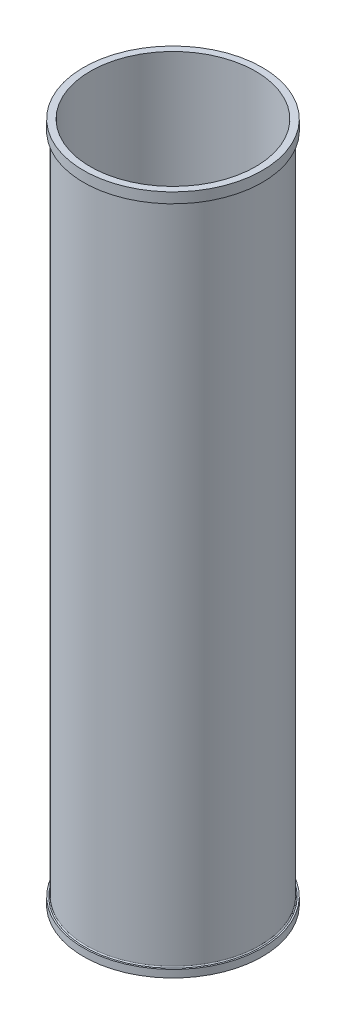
ISO-10303-21;
HEADER;
FILE_DESCRIPTION(('STEP AP214'),'2;1');
FILE_NAME('part.step','',(''),(''),'','','');
FILE_SCHEMA(('AUTOMOTIVE_DESIGN { 1 0 10303 214 1 1 1 1 }'));
ENDSEC;
DATA;
#1=APPLICATION_CONTEXT('core data for automotive mechanical design processes');
#2=APPLICATION_PROTOCOL_DEFINITION('international standard','automotive_design',2000,#1);
#3=PRODUCT_CONTEXT('',#1,'mechanical');
#4=PRODUCT('Part','Part','',(#3));
#5=PRODUCT_RELATED_PRODUCT_CATEGORY('part','',(#4));
#6=PRODUCT_DEFINITION_FORMATION('','',#4);
#7=PRODUCT_DEFINITION_CONTEXT('part definition',#1,'design');
#8=PRODUCT_DEFINITION('design','',#6,#7);
#9=PRODUCT_DEFINITION_SHAPE('','',#8);
#10=(LENGTH_UNIT() NAMED_UNIT(*) SI_UNIT(.MILLI.,.METRE.));
#11=(NAMED_UNIT(*) PLANE_ANGLE_UNIT() SI_UNIT($,.RADIAN.));
#12=(NAMED_UNIT(*) SI_UNIT($,.STERADIAN.) SOLID_ANGLE_UNIT());
#13=UNCERTAINTY_MEASURE_WITH_UNIT(LENGTH_MEASURE(1.E-05),#10,'distance_accuracy_value','');
#14=(GEOMETRIC_REPRESENTATION_CONTEXT(3) GLOBAL_UNCERTAINTY_ASSIGNED_CONTEXT((#13)) GLOBAL_UNIT_ASSIGNED_CONTEXT((#10,
#11,#12)) REPRESENTATION_CONTEXT('',''));
#15=CARTESIAN_POINT('',(0.,0.,0.));
#16=DIRECTION('',(0.,0.,1.));
#17=DIRECTION('',(1.,0.,0.));
#18=AXIS2_PLACEMENT_3D('',#15,#16,#17);
#19=CARTESIAN_POINT('',(0.,0.,0.));
#20=DIRECTION('',(0.,-1.,0.));
#21=DIRECTION('',(0.,0.,-1.));
#22=AXIS2_PLACEMENT_3D('',#19,#20,#21);
#23=CYLINDRICAL_SURFACE('',#22,109.537499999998);
#24=CARTESIAN_POINT('',(0.,838.2,0.));
#25=DIRECTION('',(0.,-1.,0.));
#26=DIRECTION('',(0.,0.,-1.));
#27=AXIS2_PLACEMENT_3D('',#24,#25,#26);
#28=CIRCLE('',#27,109.537499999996);
#29=CARTESIAN_POINT('',(0.,838.2,-109.537499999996));
#30=VERTEX_POINT('',#29);
#31=EDGE_CURVE('E40',#30,#30,#28,.T.);
#32=ORIENTED_EDGE('',*,*,#31,.T.);
#33=EDGE_LOOP('',(#32));
#34=FACE_BOUND('',#33,.T.);
#35=CARTESIAN_POINT('',(0.,825.5,0.));
#36=DIRECTION('',(0.,-1.,0.));
#37=DIRECTION('',(0.,0.,-1.));
#38=AXIS2_PLACEMENT_3D('',#35,#36,#37);
#39=CIRCLE('',#38,109.537499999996);
#40=CARTESIAN_POINT('',(0.,825.5,-109.537499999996));
#41=VERTEX_POINT('',#40);
#42=EDGE_CURVE('E71',#41,#41,#39,.T.);
#43=ORIENTED_EDGE('',*,*,#42,.F.);
#44=EDGE_LOOP('',(#43));
#45=FACE_BOUND('',#44,.T.);
#46=ADVANCED_FACE('F33',(#34,#45),#23,.T.);
#47=CARTESIAN_POINT('',(0.,3.54885663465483,0.));
#48=DIRECTION('',(0.,-1.,0.));
#49=DIRECTION('',(0.,0.,-1.));
#50=AXIS2_PLACEMENT_3D('',#47,#48,#49);
#51=CIRCLE('',#50,109.5375);
#52=CARTESIAN_POINT('',(0.,3.54885663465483,-109.5375));
#53=VERTEX_POINT('',#52);
#54=EDGE_CURVE('E44',#53,#53,#51,.T.);
#55=ORIENTED_EDGE('',*,*,#54,.F.);
#56=EDGE_LOOP('',(#55));
#57=FACE_BOUND('',#56,.T.);
#58=CARTESIAN_POINT('',(0.,12.7,0.));
#59=DIRECTION('',(0.,-1.,0.));
#60=DIRECTION('',(0.,0.,-1.));
#61=AXIS2_PLACEMENT_3D('',#58,#59,#60);
#62=CIRCLE('',#61,109.5375);
#63=CARTESIAN_POINT('',(0.,12.7,-109.5375));
#64=VERTEX_POINT('',#63);
#65=EDGE_CURVE('E68',#64,#64,#62,.T.);
#66=ORIENTED_EDGE('',*,*,#65,.T.);
#67=EDGE_LOOP('',(#66));
#68=FACE_BOUND('',#67,.T.);
#69=ADVANCED_FACE('F79',(#57,#68),#23,.T.);
#70=CARTESIAN_POINT('',(0.,0.,0.));
#71=DIRECTION('',(0.,-1.,0.));
#72=DIRECTION('',(0.,0.,-1.));
#73=AXIS2_PLACEMENT_3D('',#70,#71,#72);
#74=CYLINDRICAL_SURFACE('',#73,101.3587);
#75=CARTESIAN_POINT('',(0.,838.2,0.));
#76=DIRECTION('',(0.,-1.,0.));
#77=DIRECTION('',(0.,0.,-1.));
#78=AXIS2_PLACEMENT_3D('',#75,#76,#77);
#79=CIRCLE('',#78,101.3587);
#80=CARTESIAN_POINT('',(0.,838.2,-101.3587));
#81=VERTEX_POINT('',#80);
#82=EDGE_CURVE('E10',#81,#81,#79,.T.);
#83=ORIENTED_EDGE('',*,*,#82,.F.);
#84=EDGE_LOOP('',(#83));
#85=FACE_BOUND('',#84,.T.);
#86=CARTESIAN_POINT('',(0.,0.,0.));
#87=DIRECTION('',(0.,-1.,0.));
#88=DIRECTION('',(0.,0.,-1.));
#89=AXIS2_PLACEMENT_3D('',#86,#87,#88);
#90=CIRCLE('',#89,101.3587);
#91=CARTESIAN_POINT('',(0.,0.,-101.3587));
#92=VERTEX_POINT('',#91);
#93=EDGE_CURVE('E53',#92,#92,#90,.T.);
#94=ORIENTED_EDGE('',*,*,#93,.T.);
#95=EDGE_LOOP('',(#94));
#96=FACE_BOUND('',#95,.T.);
#97=ADVANCED_FACE('F35',(#85,#96),#74,.F.);
#98=CARTESIAN_POINT('',(-109.537499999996,838.2,0.));
#99=DIRECTION('',(0.,-1.,0.));
#100=DIRECTION('',(0.,0.,-1.));
#101=AXIS2_PLACEMENT_3D('',#98,#99,#100);
#102=PLANE('',#101);
#103=ORIENTED_EDGE('',*,*,#31,.F.);
#104=EDGE_LOOP('',(#103));
#105=FACE_BOUND('',#104,.T.);
#106=ORIENTED_EDGE('',*,*,#82,.T.);
#107=EDGE_LOOP('',(#106));
#108=FACE_BOUND('',#107,.T.);
#109=ADVANCED_FACE('F88',(#105,#108),#102,.F.);
#110=CARTESIAN_POINT('',(0.,3.54885663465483,0.));
#111=DIRECTION('',(0.,1.,0.));
#112=DIRECTION('',(0.,0.,1.));
#113=AXIS2_PLACEMENT_3D('',#110,#111,#112);
#114=CONICAL_SURFACE('',#113,109.5375,1.04719755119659);
#115=CARTESIAN_POINT('',(0.,0.,0.));
#116=DIRECTION('',(0.,-1.,0.));
#117=DIRECTION('',(0.,0.,-1.));
#118=AXIS2_PLACEMENT_3D('',#115,#116,#117);
#119=CIRCLE('',#118,103.3907);
#120=CARTESIAN_POINT('',(0.,0.,-103.3907));
#121=VERTEX_POINT('',#120);
#122=EDGE_CURVE('E48',#121,#121,#119,.T.);
#123=ORIENTED_EDGE('',*,*,#122,.F.);
#124=EDGE_LOOP('',(#123));
#125=FACE_BOUND('',#124,.T.);
#126=ORIENTED_EDGE('',*,*,#54,.T.);
#127=EDGE_LOOP('',(#126));
#128=FACE_BOUND('',#127,.T.);
#129=ADVANCED_FACE('F86',(#125,#128),#114,.T.);
#130=CARTESIAN_POINT('',(-103.3907,0.,0.));
#131=DIRECTION('',(0.,1.,0.));
#132=DIRECTION('',(0.,0.,1.));
#133=AXIS2_PLACEMENT_3D('',#130,#131,#132);
#134=PLANE('',#133);
#135=ORIENTED_EDGE('',*,*,#93,.F.);
#136=EDGE_LOOP('',(#135));
#137=FACE_BOUND('',#136,.T.);
#138=ORIENTED_EDGE('',*,*,#122,.T.);
#139=EDGE_LOOP('',(#138));
#140=FACE_BOUND('',#139,.T.);
#141=ADVANCED_FACE('F95',(#137,#140),#134,.F.);
#142=CARTESIAN_POINT('',(-109.537499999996,825.5,0.));
#143=DIRECTION('',(0.,-1.,0.));
#144=DIRECTION('',(0.,0.,-1.));
#145=AXIS2_PLACEMENT_3D('',#142,#143,#144);
#146=PLANE('',#145);
#147=ORIENTED_EDGE('',*,*,#42,.T.);
#148=EDGE_LOOP('',(#147));
#149=FACE_BOUND('',#148,.T.);
#150=CARTESIAN_POINT('',(0.,825.5,0.));
#151=DIRECTION('',(0.,-1.,0.));
#152=DIRECTION('',(0.,0.,-1.));
#153=AXIS2_PLACEMENT_3D('',#150,#151,#152);
#154=CIRCLE('',#153,107.7087);
#155=CARTESIAN_POINT('',(0.,825.5,-107.7087));
#156=VERTEX_POINT('',#155);
#157=EDGE_CURVE('E56',#156,#156,#154,.T.);
#158=ORIENTED_EDGE('',*,*,#157,.F.);
#159=EDGE_LOOP('',(#158));
#160=FACE_BOUND('',#159,.T.);
#161=ADVANCED_FACE('F75',(#149,#160),#146,.T.);
#162=CARTESIAN_POINT('',(0.,824.23,0.));
#163=DIRECTION('',(0.,-1.,0.));
#164=DIRECTION('',(0.,0.,-1.));
#165=AXIS2_PLACEMENT_3D('',#162,#163,#164);
#166=TOROIDAL_SURFACE('',#165,107.7087,1.26999999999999);
#167=ORIENTED_EDGE('',*,*,#157,.T.);
#168=EDGE_LOOP('',(#167));
#169=FACE_BOUND('',#168,.T.);
#170=CARTESIAN_POINT('',(0.,824.23,0.));
#171=DIRECTION('',(0.,-1.,0.));
#172=DIRECTION('',(0.,0.,-1.));
#173=AXIS2_PLACEMENT_3D('',#170,#171,#172);
#174=CIRCLE('',#173,106.4387);
#175=CARTESIAN_POINT('',(0.,824.23,-106.4387));
#176=VERTEX_POINT('',#175);
#177=EDGE_CURVE('E59',#176,#176,#174,.T.);
#178=ORIENTED_EDGE('',*,*,#177,.F.);
#179=EDGE_LOOP('',(#178));
#180=FACE_BOUND('',#179,.T.);
#181=ADVANCED_FACE('F125',(#169,#180),#166,.F.);
#182=CARTESIAN_POINT('',(0.,0.,0.));
#183=DIRECTION('',(0.,-1.,0.));
#184=DIRECTION('',(0.,0.,-1.));
#185=AXIS2_PLACEMENT_3D('',#182,#183,#184);
#186=CYLINDRICAL_SURFACE('',#185,106.4387);
#187=ORIENTED_EDGE('',*,*,#177,.T.);
#188=EDGE_LOOP('',(#187));
#189=FACE_BOUND('',#188,.T.);
#190=CARTESIAN_POINT('',(0.,13.97,0.));
#191=DIRECTION('',(0.,-1.,0.));
#192=DIRECTION('',(0.,0.,-1.));
#193=AXIS2_PLACEMENT_3D('',#190,#191,#192);
#194=CIRCLE('',#193,106.4387);
#195=CARTESIAN_POINT('',(0.,13.97,-106.4387));
#196=VERTEX_POINT('',#195);
#197=EDGE_CURVE('E62',#196,#196,#194,.T.);
#198=ORIENTED_EDGE('',*,*,#197,.F.);
#199=EDGE_LOOP('',(#198));
#200=FACE_BOUND('',#199,.T.);
#201=ADVANCED_FACE('F119',(#189,#200),#186,.T.);
#202=CARTESIAN_POINT('',(0.,13.97,0.));
#203=DIRECTION('',(0.,-1.,0.));
#204=DIRECTION('',(0.,0.,-1.));
#205=AXIS2_PLACEMENT_3D('',#202,#203,#204);
#206=TOROIDAL_SURFACE('',#205,107.7087,1.27);
#207=ORIENTED_EDGE('',*,*,#197,.T.);
#208=EDGE_LOOP('',(#207));
#209=FACE_BOUND('',#208,.T.);
#210=CARTESIAN_POINT('',(0.,12.7,0.));
#211=DIRECTION('',(0.,-1.,0.));
#212=DIRECTION('',(0.,0.,-1.));
#213=AXIS2_PLACEMENT_3D('',#210,#211,#212);
#214=CIRCLE('',#213,107.7087);
#215=CARTESIAN_POINT('',(0.,12.7,-107.7087));
#216=VERTEX_POINT('',#215);
#217=EDGE_CURVE('E65',#216,#216,#214,.T.);
#218=ORIENTED_EDGE('',*,*,#217,.F.);
#219=EDGE_LOOP('',(#218));
#220=FACE_BOUND('',#219,.T.);
#221=ADVANCED_FACE('F113',(#209,#220),#206,.F.);
#222=CARTESIAN_POINT('',(-109.5375,12.7,0.));
#223=DIRECTION('',(0.,1.,0.));
#224=DIRECTION('',(0.,0.,1.));
#225=AXIS2_PLACEMENT_3D('',#222,#223,#224);
#226=PLANE('',#225);
#227=ORIENTED_EDGE('',*,*,#217,.T.);
#228=EDGE_LOOP('',(#227));
#229=FACE_BOUND('',#228,.T.);
#230=ORIENTED_EDGE('',*,*,#65,.F.);
#231=EDGE_LOOP('',(#230));
#232=FACE_BOUND('',#231,.T.);
#233=ADVANCED_FACE('F111',(#229,#232),#226,.T.);
#234=CLOSED_SHELL('',(#46,#69,#97,#109,#129,#141,#161,#181,#201,#221,#233));
#235=MANIFOLD_SOLID_BREP('B2',#234);
#236=ADVANCED_BREP_SHAPE_REPRESENTATION('',(#18,#235),#14);
#237=SHAPE_DEFINITION_REPRESENTATION(#9,#236);
ENDSEC;
END-ISO-10303-21;
